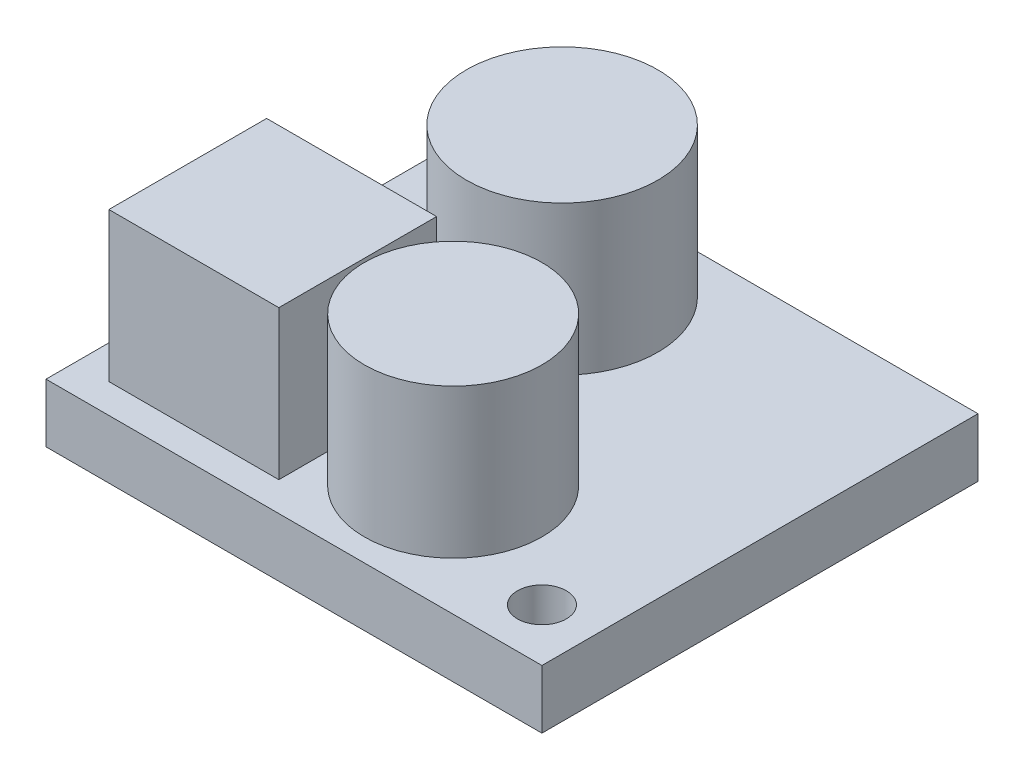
ISO-10303-21;
HEADER;
FILE_DESCRIPTION(('STEP AP214'),'2;1');
FILE_NAME('part.step','',(''),(''),'','','');
FILE_SCHEMA(('AUTOMOTIVE_DESIGN { 1 0 10303 214 1 1 1 1 }'));
ENDSEC;
DATA;
#1=APPLICATION_CONTEXT('core data for automotive mechanical design processes');
#2=APPLICATION_PROTOCOL_DEFINITION('international standard','automotive_design',2000,#1);
#3=PRODUCT_CONTEXT('',#1,'mechanical');
#4=PRODUCT('Part','Part','',(#3));
#5=PRODUCT_RELATED_PRODUCT_CATEGORY('part','',(#4));
#6=PRODUCT_DEFINITION_FORMATION('','',#4);
#7=PRODUCT_DEFINITION_CONTEXT('part definition',#1,'design');
#8=PRODUCT_DEFINITION('design','',#6,#7);
#9=PRODUCT_DEFINITION_SHAPE('','',#8);
#10=(LENGTH_UNIT() NAMED_UNIT(*) SI_UNIT(.MILLI.,.METRE.));
#11=(NAMED_UNIT(*) PLANE_ANGLE_UNIT() SI_UNIT($,.RADIAN.));
#12=(NAMED_UNIT(*) SI_UNIT($,.STERADIAN.) SOLID_ANGLE_UNIT());
#13=UNCERTAINTY_MEASURE_WITH_UNIT(LENGTH_MEASURE(1.E-05),#10,'distance_accuracy_value','');
#14=(GEOMETRIC_REPRESENTATION_CONTEXT(3) GLOBAL_UNCERTAINTY_ASSIGNED_CONTEXT((#13)) GLOBAL_UNIT_ASSIGNED_CONTEXT((#10,
#11,#12)) REPRESENTATION_CONTEXT('',''));
#15=CARTESIAN_POINT('',(0.,0.,0.));
#16=DIRECTION('',(0.,0.,1.));
#17=DIRECTION('',(1.,0.,0.));
#18=AXIS2_PLACEMENT_3D('',#15,#16,#17);
#19=CARTESIAN_POINT('',(0.,2.4,0.));
#20=DIRECTION('',(0.,-1.,0.));
#21=DIRECTION('',(0.,0.,-1.));
#22=AXIS2_PLACEMENT_3D('',#19,#20,#21);
#23=PLANE('',#22);
#24=CARTESIAN_POINT('',(7.65247315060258,2.4,-13.4740667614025));
#25=DIRECTION('',(0.,1.,0.));
#26=DIRECTION('',(0.,0.,1.));
#27=AXIS2_PLACEMENT_3D('',#24,#25,#26);
#28=CIRCLE('',#27,3.91705531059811);
#29=CARTESIAN_POINT('',(7.65247315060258,2.4,-9.55701145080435));
#30=VERTEX_POINT('',#29);
#31=EDGE_CURVE('E172',#30,#30,#28,.T.);
#32=ORIENTED_EDGE('',*,*,#31,.F.);
#33=EDGE_LOOP('',(#32));
#34=FACE_BOUND('',#33,.T.);
#35=CARTESIAN_POINT('',(12.1123425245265,2.4,-4.55432801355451));
#36=DIRECTION('',(0.,1.,0.));
#37=DIRECTION('',(0.,0.,1.));
#38=AXIS2_PLACEMENT_3D('',#35,#36,#37);
#39=CIRCLE('',#38,3.63330205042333);
#40=CARTESIAN_POINT('',(12.1123425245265,2.4,-0.921025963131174));
#41=VERTEX_POINT('',#40);
#42=EDGE_CURVE('E175',#41,#41,#39,.T.);
#43=ORIENTED_EDGE('',*,*,#42,.F.);
#44=EDGE_LOOP('',(#43));
#45=FACE_BOUND('',#44,.T.);
#46=CARTESIAN_POINT('',(18.15,2.4,-2.15));
#47=DIRECTION('',(0.,1.,0.));
#48=DIRECTION('',(0.,0.,1.));
#49=AXIS2_PLACEMENT_3D('',#46,#47,#48);
#50=CIRCLE('',#49,1.);
#51=CARTESIAN_POINT('',(18.15,2.4,-1.15));
#52=VERTEX_POINT('',#51);
#53=EDGE_CURVE('E179',#52,#52,#50,.T.);
#54=ORIENTED_EDGE('',*,*,#53,.F.);
#55=EDGE_LOOP('',(#54));
#56=FACE_BOUND('',#55,.T.);
#57=CARTESIAN_POINT('',(2.15,2.4,-15.7));
#58=DIRECTION('',(0.,1.,0.));
#59=DIRECTION('',(0.,0.,1.));
#60=AXIS2_PLACEMENT_3D('',#57,#58,#59);
#61=CIRCLE('',#60,1.);
#62=CARTESIAN_POINT('',(2.15,2.4,-14.7));
#63=VERTEX_POINT('',#62);
#64=EDGE_CURVE('E185',#63,#63,#61,.T.);
#65=ORIENTED_EDGE('',*,*,#64,.F.);
#66=EDGE_LOOP('',(#65));
#67=FACE_BOUND('',#66,.T.);
#68=DIRECTION('',(0.,0.,1.));
#69=VECTOR('',#68,1.);
#70=CARTESIAN_POINT('',(0.,2.4,0.));
#71=LINE('',#70,#69);
#72=CARTESIAN_POINT('',(0.,2.4,-17.85));
#73=VERTEX_POINT('',#72);
#74=CARTESIAN_POINT('',(0.,2.4,0.));
#75=VERTEX_POINT('',#74);
#76=EDGE_CURVE('E192',#73,#75,#71,.T.);
#77=ORIENTED_EDGE('',*,*,#76,.T.);
#78=DIRECTION('',(1.,0.,0.));
#79=VECTOR('',#78,1.);
#80=CARTESIAN_POINT('',(0.,2.4,0.));
#81=LINE('',#80,#79);
#82=CARTESIAN_POINT('',(20.3,2.4,0.));
#83=VERTEX_POINT('',#82);
#84=EDGE_CURVE('E106',#75,#83,#81,.T.);
#85=ORIENTED_EDGE('',*,*,#84,.T.);
#86=DIRECTION('',(0.,0.,-1.));
#87=VECTOR('',#86,1.);
#88=CARTESIAN_POINT('',(20.3,2.4,0.));
#89=LINE('',#88,#87);
#90=CARTESIAN_POINT('',(20.3,2.4,-17.85));
#91=VERTEX_POINT('',#90);
#92=EDGE_CURVE('E197',#83,#91,#89,.T.);
#93=ORIENTED_EDGE('',*,*,#92,.T.);
#94=DIRECTION('',(-1.,0.,0.));
#95=VECTOR('',#94,1.);
#96=CARTESIAN_POINT('',(0.,2.4,-17.85));
#97=LINE('',#96,#95);
#98=EDGE_CURVE('E74',#91,#73,#97,.T.);
#99=ORIENTED_EDGE('',*,*,#98,.T.);
#100=EDGE_LOOP('',(#77,#85,#93,#99));
#101=FACE_BOUND('',#100,.T.);
#102=DIRECTION('',(0.,0.,1.));
#103=VECTOR('',#102,1.);
#104=CARTESIAN_POINT('',(1.37297707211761,2.4,-1.20050624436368));
#105=LINE('',#104,#103);
#106=CARTESIAN_POINT('',(1.37297707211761,2.4,-7.65839709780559));
#107=VERTEX_POINT('',#106);
#108=CARTESIAN_POINT('',(1.37297707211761,2.4,-1.20050624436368));
#109=VERTEX_POINT('',#108);
#110=EDGE_CURVE('E157',#107,#109,#105,.T.);
#111=ORIENTED_EDGE('',*,*,#110,.F.);
#112=DIRECTION('',(-1.,0.,0.));
#113=VECTOR('',#112,1.);
#114=CARTESIAN_POINT('',(1.37297707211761,2.4,-7.65839709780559));
#115=LINE('',#114,#113);
#116=CARTESIAN_POINT('',(8.33037329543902,2.4,-7.65839709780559));
#117=VERTEX_POINT('',#116);
#118=EDGE_CURVE('E63',#117,#107,#115,.T.);
#119=ORIENTED_EDGE('',*,*,#118,.F.);
#120=DIRECTION('',(0.,0.,-1.));
#121=VECTOR('',#120,1.);
#122=CARTESIAN_POINT('',(8.33037329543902,2.4,-1.20050624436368));
#123=LINE('',#122,#121);
#124=CARTESIAN_POINT('',(8.33037329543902,2.4,-1.20050624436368));
#125=VERTEX_POINT('',#124);
#126=EDGE_CURVE('E168',#125,#117,#123,.T.);
#127=ORIENTED_EDGE('',*,*,#126,.F.);
#128=DIRECTION('',(1.,0.,0.));
#129=VECTOR('',#128,1.);
#130=CARTESIAN_POINT('',(1.37297707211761,2.4,-1.20050624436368));
#131=LINE('',#130,#129);
#132=EDGE_CURVE('E155',#109,#125,#131,.T.);
#133=ORIENTED_EDGE('',*,*,#132,.F.);
#134=EDGE_LOOP('',(#111,#119,#127,#133));
#135=FACE_BOUND('',#134,.T.);
#136=ADVANCED_FACE('F47',(#34,#45,#56,#67,#101,#135),#23,.F.);
#137=CARTESIAN_POINT('',(0.,0.,0.));
#138=DIRECTION('',(0.,-1.,0.));
#139=DIRECTION('',(0.,0.,-1.));
#140=AXIS2_PLACEMENT_3D('',#137,#138,#139);
#141=PLANE('',#140);
#142=CARTESIAN_POINT('',(2.15,0.,-15.7));
#143=DIRECTION('',(0.,1.,0.));
#144=DIRECTION('',(0.,0.,1.));
#145=AXIS2_PLACEMENT_3D('',#142,#143,#144);
#146=CIRCLE('',#145,1.);
#147=CARTESIAN_POINT('',(2.15,0.,-14.7));
#148=VERTEX_POINT('',#147);
#149=EDGE_CURVE('E182',#148,#148,#146,.T.);
#150=ORIENTED_EDGE('',*,*,#149,.T.);
#151=EDGE_LOOP('',(#150));
#152=FACE_BOUND('',#151,.T.);
#153=DIRECTION('',(0.,0.,1.));
#154=VECTOR('',#153,1.);
#155=CARTESIAN_POINT('',(0.,0.,0.));
#156=LINE('',#155,#154);
#157=CARTESIAN_POINT('',(0.,0.,-17.85));
#158=VERTEX_POINT('',#157);
#159=CARTESIAN_POINT('',(0.,0.,0.));
#160=VERTEX_POINT('',#159);
#161=EDGE_CURVE('E189',#158,#160,#156,.T.);
#162=ORIENTED_EDGE('',*,*,#161,.F.);
#163=DIRECTION('',(-1.,0.,0.));
#164=VECTOR('',#163,1.);
#165=CARTESIAN_POINT('',(0.,0.,-17.85));
#166=LINE('',#165,#164);
#167=CARTESIAN_POINT('',(20.3,0.,-17.85));
#168=VERTEX_POINT('',#167);
#169=EDGE_CURVE('E96',#168,#158,#166,.T.);
#170=ORIENTED_EDGE('',*,*,#169,.F.);
#171=DIRECTION('',(0.,0.,-1.));
#172=VECTOR('',#171,1.);
#173=CARTESIAN_POINT('',(20.3,0.,0.));
#174=LINE('',#173,#172);
#175=CARTESIAN_POINT('',(20.3,0.,0.));
#176=VERTEX_POINT('',#175);
#177=EDGE_CURVE('E207',#176,#168,#174,.T.);
#178=ORIENTED_EDGE('',*,*,#177,.F.);
#179=DIRECTION('',(1.,0.,0.));
#180=VECTOR('',#179,1.);
#181=CARTESIAN_POINT('',(0.,0.,0.));
#182=LINE('',#181,#180);
#183=EDGE_CURVE('E205',#160,#176,#182,.T.);
#184=ORIENTED_EDGE('',*,*,#183,.F.);
#185=EDGE_LOOP('',(#162,#170,#178,#184));
#186=FACE_BOUND('',#185,.T.);
#187=CARTESIAN_POINT('',(18.15,0.,-2.15));
#188=DIRECTION('',(0.,1.,0.));
#189=DIRECTION('',(0.,0.,1.));
#190=AXIS2_PLACEMENT_3D('',#187,#188,#189);
#191=CIRCLE('',#190,1.);
#192=CARTESIAN_POINT('',(18.15,0.,-1.15));
#193=VERTEX_POINT('',#192);
#194=EDGE_CURVE('E178',#193,#193,#191,.T.);
#195=ORIENTED_EDGE('',*,*,#194,.T.);
#196=EDGE_LOOP('',(#195));
#197=FACE_BOUND('',#196,.T.);
#198=ADVANCED_FACE('F222',(#152,#186,#197),#141,.T.);
#199=CARTESIAN_POINT('',(0.,2.4,0.));
#200=DIRECTION('',(1.,0.,0.));
#201=DIRECTION('',(0.,0.,-1.));
#202=AXIS2_PLACEMENT_3D('',#199,#200,#201);
#203=PLANE('',#202);
#204=ORIENTED_EDGE('',*,*,#161,.T.);
#205=DIRECTION('',(0.,-1.,0.));
#206=VECTOR('',#205,1.);
#207=CARTESIAN_POINT('',(0.,2.4,0.));
#208=LINE('',#207,#206);
#209=EDGE_CURVE('E11',#75,#160,#208,.T.);
#210=ORIENTED_EDGE('',*,*,#209,.F.);
#211=ORIENTED_EDGE('',*,*,#76,.F.);
#212=DIRECTION('',(0.,-1.,0.));
#213=VECTOR('',#212,1.);
#214=CARTESIAN_POINT('',(0.,2.4,-17.85));
#215=LINE('',#214,#213);
#216=EDGE_CURVE('E201',#73,#158,#215,.T.);
#217=ORIENTED_EDGE('',*,*,#216,.T.);
#218=EDGE_LOOP('',(#204,#210,#211,#217));
#219=FACE_BOUND('',#218,.T.);
#220=ADVANCED_FACE('F49',(#219),#203,.F.);
#221=CARTESIAN_POINT('',(0.,2.4,0.));
#222=DIRECTION('',(0.,0.,-1.));
#223=DIRECTION('',(-1.,0.,0.));
#224=AXIS2_PLACEMENT_3D('',#221,#222,#223);
#225=PLANE('',#224);
#226=ORIENTED_EDGE('',*,*,#183,.T.);
#227=DIRECTION('',(0.,-1.,0.));
#228=VECTOR('',#227,1.);
#229=CARTESIAN_POINT('',(20.3,2.4,0.));
#230=LINE('',#229,#228);
#231=EDGE_CURVE('E56',#83,#176,#230,.T.);
#232=ORIENTED_EDGE('',*,*,#231,.F.);
#233=ORIENTED_EDGE('',*,*,#84,.F.);
#234=ORIENTED_EDGE('',*,*,#209,.T.);
#235=EDGE_LOOP('',(#226,#232,#233,#234));
#236=FACE_BOUND('',#235,.T.);
#237=ADVANCED_FACE('F238',(#236),#225,.F.);
#238=CARTESIAN_POINT('',(20.3,2.4,0.));
#239=DIRECTION('',(-1.,0.,0.));
#240=DIRECTION('',(0.,0.,1.));
#241=AXIS2_PLACEMENT_3D('',#238,#239,#240);
#242=PLANE('',#241);
#243=ORIENTED_EDGE('',*,*,#177,.T.);
#244=DIRECTION('',(0.,-1.,0.));
#245=VECTOR('',#244,1.);
#246=CARTESIAN_POINT('',(20.3,2.4,-17.85));
#247=LINE('',#246,#245);
#248=EDGE_CURVE('E213',#91,#168,#247,.T.);
#249=ORIENTED_EDGE('',*,*,#248,.F.);
#250=ORIENTED_EDGE('',*,*,#92,.F.);
#251=ORIENTED_EDGE('',*,*,#231,.T.);
#252=EDGE_LOOP('',(#243,#249,#250,#251));
#253=FACE_BOUND('',#252,.T.);
#254=ADVANCED_FACE('F218',(#253),#242,.F.);
#255=CARTESIAN_POINT('',(0.,2.4,-17.85));
#256=DIRECTION('',(0.,0.,1.));
#257=DIRECTION('',(1.,0.,0.));
#258=AXIS2_PLACEMENT_3D('',#255,#256,#257);
#259=PLANE('',#258);
#260=ORIENTED_EDGE('',*,*,#169,.T.);
#261=ORIENTED_EDGE('',*,*,#216,.F.);
#262=ORIENTED_EDGE('',*,*,#98,.F.);
#263=ORIENTED_EDGE('',*,*,#248,.T.);
#264=EDGE_LOOP('',(#260,#261,#262,#263));
#265=FACE_BOUND('',#264,.T.);
#266=ADVANCED_FACE('F227',(#265),#259,.F.);
#267=CARTESIAN_POINT('',(2.15,2.4,-15.7));
#268=DIRECTION('',(0.,-1.,0.));
#269=DIRECTION('',(0.,0.,-1.));
#270=AXIS2_PLACEMENT_3D('',#267,#268,#269);
#271=CYLINDRICAL_SURFACE('',#270,1.);
#272=ORIENTED_EDGE('',*,*,#64,.T.);
#273=EDGE_LOOP('',(#272));
#274=FACE_BOUND('',#273,.T.);
#275=ORIENTED_EDGE('',*,*,#149,.F.);
#276=EDGE_LOOP('',(#275));
#277=FACE_BOUND('',#276,.T.);
#278=ADVANCED_FACE('F229',(#274,#277),#271,.F.);
#279=CARTESIAN_POINT('',(18.15,2.4,-2.15));
#280=DIRECTION('',(0.,-1.,0.));
#281=DIRECTION('',(0.,0.,-1.));
#282=AXIS2_PLACEMENT_3D('',#279,#280,#281);
#283=CYLINDRICAL_SURFACE('',#282,1.);
#284=ORIENTED_EDGE('',*,*,#53,.T.);
#285=EDGE_LOOP('',(#284));
#286=FACE_BOUND('',#285,.T.);
#287=ORIENTED_EDGE('',*,*,#194,.F.);
#288=EDGE_LOOP('',(#287));
#289=FACE_BOUND('',#288,.T.);
#290=ADVANCED_FACE('F235',(#286,#289),#283,.F.);
#291=CARTESIAN_POINT('',(0.,8.5,-1.20050624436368));
#292=DIRECTION('',(0.,0.,-1.));
#293=DIRECTION('',(-1.,0.,0.));
#294=AXIS2_PLACEMENT_3D('',#291,#292,#293);
#295=PLANE('',#294);
#296=DIRECTION('',(0.,-1.,0.));
#297=VECTOR('',#296,1.);
#298=CARTESIAN_POINT('',(1.37297707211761,8.5,-1.20050624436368));
#299=LINE('',#298,#297);
#300=CARTESIAN_POINT('',(1.37297707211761,8.5,-1.20050624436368));
#301=VERTEX_POINT('',#300);
#302=EDGE_CURVE('E296',#301,#109,#299,.T.);
#303=ORIENTED_EDGE('',*,*,#302,.T.);
#304=ORIENTED_EDGE('',*,*,#132,.T.);
#305=DIRECTION('',(0.,-1.,0.));
#306=VECTOR('',#305,1.);
#307=CARTESIAN_POINT('',(8.33037329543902,8.5,-1.20050624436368));
#308=LINE('',#307,#306);
#309=CARTESIAN_POINT('',(8.33037329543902,8.5,-1.20050624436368));
#310=VERTEX_POINT('',#309);
#311=EDGE_CURVE('E133',#310,#125,#308,.T.);
#312=ORIENTED_EDGE('',*,*,#311,.F.);
#313=DIRECTION('',(1.,0.,0.));
#314=VECTOR('',#313,1.);
#315=CARTESIAN_POINT('',(0.,8.5,-1.20050624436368));
#316=LINE('',#315,#314);
#317=EDGE_CURVE('E141',#301,#310,#316,.T.);
#318=ORIENTED_EDGE('',*,*,#317,.F.);
#319=EDGE_LOOP('',(#303,#304,#312,#318));
#320=FACE_BOUND('',#319,.T.);
#321=ADVANCED_FACE('F154',(#320),#295,.F.);
#322=CARTESIAN_POINT('',(0.,8.5,-7.65839709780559));
#323=DIRECTION('',(0.,0.,-1.));
#324=DIRECTION('',(-1.,0.,0.));
#325=AXIS2_PLACEMENT_3D('',#322,#323,#324);
#326=PLANE('',#325);
#327=ORIENTED_EDGE('',*,*,#118,.T.);
#328=DIRECTION('',(0.,-1.,0.));
#329=VECTOR('',#328,1.);
#330=CARTESIAN_POINT('',(1.37297707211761,8.5,-7.65839709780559));
#331=LINE('',#330,#329);
#332=CARTESIAN_POINT('',(1.37297707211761,8.5,-7.65839709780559));
#333=VERTEX_POINT('',#332);
#334=EDGE_CURVE('E163',#333,#107,#331,.T.);
#335=ORIENTED_EDGE('',*,*,#334,.F.);
#336=DIRECTION('',(1.,0.,0.));
#337=VECTOR('',#336,1.);
#338=CARTESIAN_POINT('',(0.,8.5,-7.65839709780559));
#339=LINE('',#338,#337);
#340=CARTESIAN_POINT('',(8.33037329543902,8.5,-7.65839709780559));
#341=VERTEX_POINT('',#340);
#342=EDGE_CURVE('E140',#333,#341,#339,.T.);
#343=ORIENTED_EDGE('',*,*,#342,.T.);
#344=DIRECTION('',(0.,-1.,0.));
#345=VECTOR('',#344,1.);
#346=CARTESIAN_POINT('',(8.33037329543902,8.5,-7.65839709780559));
#347=LINE('',#346,#345);
#348=EDGE_CURVE('E135',#341,#117,#347,.T.);
#349=ORIENTED_EDGE('',*,*,#348,.T.);
#350=EDGE_LOOP('',(#327,#335,#343,#349));
#351=FACE_BOUND('',#350,.T.);
#352=ADVANCED_FACE('F256',(#351),#326,.T.);
#353=CARTESIAN_POINT('',(8.33037329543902,8.5,0.));
#354=DIRECTION('',(-1.,0.,0.));
#355=DIRECTION('',(0.,0.,1.));
#356=AXIS2_PLACEMENT_3D('',#353,#354,#355);
#357=PLANE('',#356);
#358=ORIENTED_EDGE('',*,*,#311,.T.);
#359=ORIENTED_EDGE('',*,*,#126,.T.);
#360=ORIENTED_EDGE('',*,*,#348,.F.);
#361=DIRECTION('',(0.,0.,-1.));
#362=VECTOR('',#361,1.);
#363=CARTESIAN_POINT('',(8.33037329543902,8.5,0.));
#364=LINE('',#363,#362);
#365=EDGE_CURVE('E129',#310,#341,#364,.T.);
#366=ORIENTED_EDGE('',*,*,#365,.F.);
#367=EDGE_LOOP('',(#358,#359,#360,#366));
#368=FACE_BOUND('',#367,.T.);
#369=ADVANCED_FACE('F131',(#368),#357,.F.);
#370=CARTESIAN_POINT('',(1.37297707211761,8.5,0.));
#371=DIRECTION('',(-1.,0.,0.));
#372=DIRECTION('',(0.,0.,1.));
#373=AXIS2_PLACEMENT_3D('',#370,#371,#372);
#374=PLANE('',#373);
#375=ORIENTED_EDGE('',*,*,#110,.T.);
#376=ORIENTED_EDGE('',*,*,#302,.F.);
#377=DIRECTION('',(0.,0.,-1.));
#378=VECTOR('',#377,1.);
#379=CARTESIAN_POINT('',(1.37297707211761,8.5,0.));
#380=LINE('',#379,#378);
#381=EDGE_CURVE('E147',#301,#333,#380,.T.);
#382=ORIENTED_EDGE('',*,*,#381,.T.);
#383=ORIENTED_EDGE('',*,*,#334,.T.);
#384=EDGE_LOOP('',(#375,#376,#382,#383));
#385=FACE_BOUND('',#384,.T.);
#386=ADVANCED_FACE('F259',(#385),#374,.T.);
#387=CARTESIAN_POINT('',(0.,8.5,0.));
#388=DIRECTION('',(0.,1.,0.));
#389=DIRECTION('',(0.,0.,1.));
#390=AXIS2_PLACEMENT_3D('',#387,#388,#389);
#391=PLANE('',#390);
#392=ORIENTED_EDGE('',*,*,#317,.T.);
#393=ORIENTED_EDGE('',*,*,#365,.T.);
#394=ORIENTED_EDGE('',*,*,#342,.F.);
#395=ORIENTED_EDGE('',*,*,#381,.F.);
#396=EDGE_LOOP('',(#392,#393,#394,#395));
#397=FACE_BOUND('',#396,.T.);
#398=ADVANCED_FACE('F145',(#397),#391,.T.);
#399=CARTESIAN_POINT('',(12.1123425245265,8.5,-4.55432801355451));
#400=DIRECTION('',(0.,-1.,0.));
#401=DIRECTION('',(0.,0.,-1.));
#402=AXIS2_PLACEMENT_3D('',#399,#400,#401);
#403=CYLINDRICAL_SURFACE('',#402,3.63330205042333);
#404=CARTESIAN_POINT('',(12.1123425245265,8.5,-4.55432801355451));
#405=DIRECTION('',(0.,1.,0.));
#406=DIRECTION('',(0.,0.,1.));
#407=AXIS2_PLACEMENT_3D('',#404,#405,#406);
#408=CIRCLE('',#407,3.63330205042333);
#409=CARTESIAN_POINT('',(12.1123425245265,8.5,-0.921025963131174));
#410=VERTEX_POINT('',#409);
#411=EDGE_CURVE('E151',#410,#410,#408,.T.);
#412=ORIENTED_EDGE('',*,*,#411,.F.);
#413=EDGE_LOOP('',(#412));
#414=FACE_BOUND('',#413,.T.);
#415=ORIENTED_EDGE('',*,*,#42,.T.);
#416=EDGE_LOOP('',(#415));
#417=FACE_BOUND('',#416,.T.);
#418=ADVANCED_FACE('F268',(#414,#417),#403,.T.);
#419=CARTESIAN_POINT('',(0.,8.5,0.));
#420=DIRECTION('',(0.,1.,0.));
#421=DIRECTION('',(0.,0.,1.));
#422=AXIS2_PLACEMENT_3D('',#419,#420,#421);
#423=PLANE('',#422);
#424=ORIENTED_EDGE('',*,*,#411,.T.);
#425=EDGE_LOOP('',(#424));
#426=FACE_BOUND('',#425,.T.);
#427=ADVANCED_FACE('F273',(#426),#423,.T.);
#428=CARTESIAN_POINT('',(7.65247315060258,8.5,-13.4740667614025));
#429=DIRECTION('',(0.,-1.,0.));
#430=DIRECTION('',(0.,0.,-1.));
#431=AXIS2_PLACEMENT_3D('',#428,#429,#430);
#432=CYLINDRICAL_SURFACE('',#431,3.91705531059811);
#433=CARTESIAN_POINT('',(7.65247315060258,8.5,-13.4740667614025));
#434=DIRECTION('',(0.,1.,0.));
#435=DIRECTION('',(0.,0.,1.));
#436=AXIS2_PLACEMENT_3D('',#433,#434,#435);
#437=CIRCLE('',#436,3.91705531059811);
#438=CARTESIAN_POINT('',(7.65247315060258,8.5,-9.55701145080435));
#439=VERTEX_POINT('',#438);
#440=EDGE_CURVE('E287',#439,#439,#437,.T.);
#441=ORIENTED_EDGE('',*,*,#440,.F.);
#442=EDGE_LOOP('',(#441));
#443=FACE_BOUND('',#442,.T.);
#444=ORIENTED_EDGE('',*,*,#31,.T.);
#445=EDGE_LOOP('',(#444));
#446=FACE_BOUND('',#445,.T.);
#447=ADVANCED_FACE('F269',(#443,#446),#432,.T.);
#448=CARTESIAN_POINT('',(0.,8.5,0.));
#449=DIRECTION('',(0.,1.,0.));
#450=DIRECTION('',(0.,0.,1.));
#451=AXIS2_PLACEMENT_3D('',#448,#449,#450);
#452=PLANE('',#451);
#453=ORIENTED_EDGE('',*,*,#440,.T.);
#454=EDGE_LOOP('',(#453));
#455=FACE_BOUND('',#454,.T.);
#456=ADVANCED_FACE('F272',(#455),#452,.T.);
#457=CLOSED_SHELL('',(#136,#198,#220,#237,#254,#266,#278,#290,#321,#352,#369,#386,#398,#418,
#427,#447,#456));
#458=MANIFOLD_SOLID_BREP('B2',#457);
#459=ADVANCED_BREP_SHAPE_REPRESENTATION('',(#18,#458),#14);
#460=SHAPE_DEFINITION_REPRESENTATION(#9,#459);
ENDSEC;
END-ISO-10303-21;
